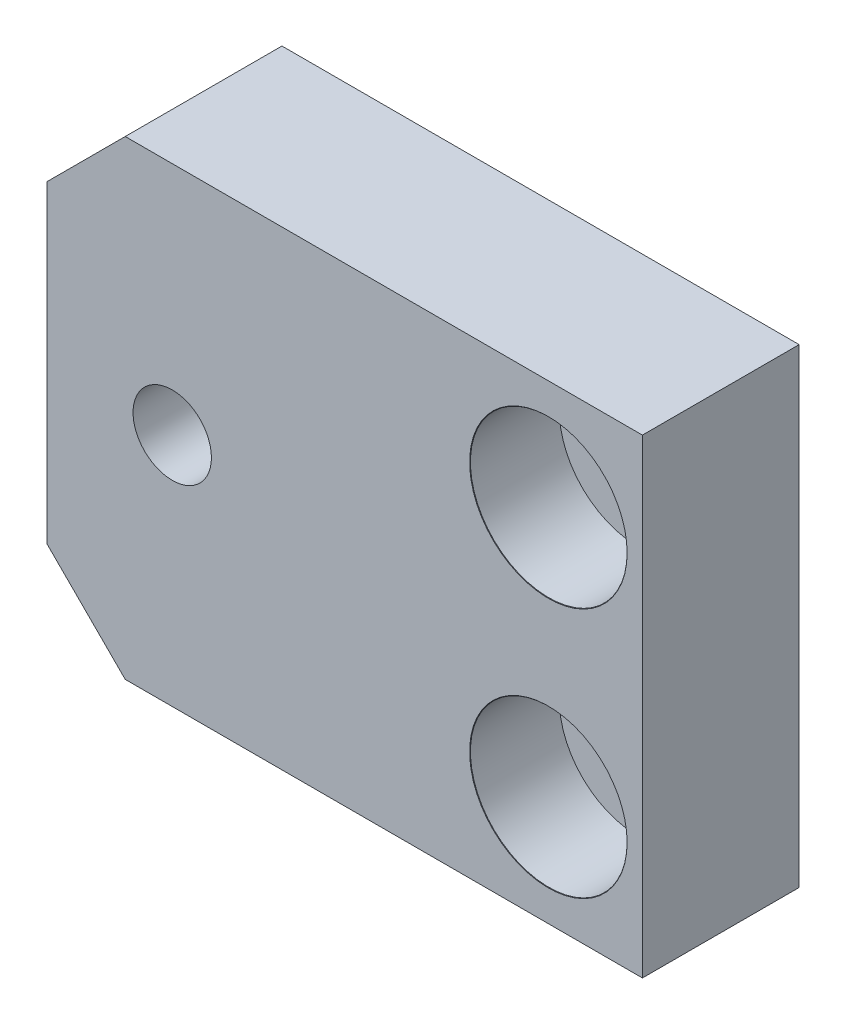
ISO-10303-21;
HEADER;
FILE_DESCRIPTION(('STEP AP214'),'2;1');
FILE_NAME('part.step','',(''),(''),'','','');
FILE_SCHEMA(('AUTOMOTIVE_DESIGN { 1 0 10303 214 1 1 1 1 }'));
ENDSEC;
DATA;
#1=APPLICATION_CONTEXT('core data for automotive mechanical design processes');
#2=APPLICATION_PROTOCOL_DEFINITION('international standard','automotive_design',2000,#1);
#3=PRODUCT_CONTEXT('',#1,'mechanical');
#4=PRODUCT('Part','Part','',(#3));
#5=PRODUCT_RELATED_PRODUCT_CATEGORY('part','',(#4));
#6=PRODUCT_DEFINITION_FORMATION('','',#4);
#7=PRODUCT_DEFINITION_CONTEXT('part definition',#1,'design');
#8=PRODUCT_DEFINITION('design','',#6,#7);
#9=PRODUCT_DEFINITION_SHAPE('','',#8);
#10=(LENGTH_UNIT() NAMED_UNIT(*) SI_UNIT(.MILLI.,.METRE.));
#11=(NAMED_UNIT(*) PLANE_ANGLE_UNIT() SI_UNIT($,.RADIAN.));
#12=(NAMED_UNIT(*) SI_UNIT($,.STERADIAN.) SOLID_ANGLE_UNIT());
#13=UNCERTAINTY_MEASURE_WITH_UNIT(LENGTH_MEASURE(1.E-05),#10,'distance_accuracy_value','');
#14=(GEOMETRIC_REPRESENTATION_CONTEXT(3) GLOBAL_UNCERTAINTY_ASSIGNED_CONTEXT((#13)) GLOBAL_UNIT_ASSIGNED_CONTEXT((#10,
#11,#12)) REPRESENTATION_CONTEXT('',''));
#15=CARTESIAN_POINT('',(0.,0.,0.));
#16=DIRECTION('',(0.,0.,1.));
#17=DIRECTION('',(1.,0.,0.));
#18=AXIS2_PLACEMENT_3D('',#15,#16,#17);
#19=CARTESIAN_POINT('',(41.4927569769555,-2.53999999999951,10.));
#20=DIRECTION('',(-1.,0.,0.));
#21=DIRECTION('',(0.,0.,1.));
#22=AXIS2_PLACEMENT_3D('',#19,#20,#21);
#23=PLANE('',#22);
#24=DIRECTION('',(0.,1.,0.));
#25=VECTOR('',#24,1.);
#26=CARTESIAN_POINT('',(41.4927569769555,-2.53999999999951,0.));
#27=LINE('',#26,#25);
#28=CARTESIAN_POINT('',(41.4927569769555,-2.53999999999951,0.));
#29=VERTEX_POINT('',#28);
#30=CARTESIAN_POINT('',(41.4927569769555,27.4600000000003,0.));
#31=VERTEX_POINT('',#30);
#32=EDGE_CURVE('E89',#29,#31,#27,.T.);
#33=ORIENTED_EDGE('',*,*,#32,.T.);
#34=DIRECTION('',(0.,0.,-1.));
#35=VECTOR('',#34,1.);
#36=CARTESIAN_POINT('',(41.4927569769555,27.4600000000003,10.));
#37=LINE('',#36,#35);
#38=CARTESIAN_POINT('',(41.4927569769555,27.4600000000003,10.));
#39=VERTEX_POINT('',#38);
#40=EDGE_CURVE('E72',#39,#31,#37,.T.);
#41=ORIENTED_EDGE('',*,*,#40,.F.);
#42=DIRECTION('',(0.,1.,0.));
#43=VECTOR('',#42,1.);
#44=CARTESIAN_POINT('',(41.4927569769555,-2.53999999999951,10.));
#45=LINE('',#44,#43);
#46=CARTESIAN_POINT('',(41.4927569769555,-2.53999999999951,10.));
#47=VERTEX_POINT('',#46);
#48=EDGE_CURVE('E77',#47,#39,#45,.T.);
#49=ORIENTED_EDGE('',*,*,#48,.F.);
#50=DIRECTION('',(0.,0.,-1.));
#51=VECTOR('',#50,1.);
#52=CARTESIAN_POINT('',(41.4927569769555,-2.53999999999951,10.));
#53=LINE('',#52,#51);
#54=EDGE_CURVE('E91',#47,#29,#53,.T.);
#55=ORIENTED_EDGE('',*,*,#54,.T.);
#56=EDGE_LOOP('',(#33,#41,#49,#55));
#57=FACE_BOUND('',#56,.T.);
#58=ADVANCED_FACE('F16',(#57),#23,.F.);
#59=CARTESIAN_POINT('',(41.4927569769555,27.4600000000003,10.));
#60=DIRECTION('',(0.,-1.,0.));
#61=DIRECTION('',(1.,0.,0.));
#62=AXIS2_PLACEMENT_3D('',#59,#60,#61);
#63=PLANE('',#62);
#64=DIRECTION('',(-1.,0.,0.));
#65=VECTOR('',#64,1.);
#66=CARTESIAN_POINT('',(41.4927569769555,27.4600000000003,0.));
#67=LINE('',#66,#65);
#68=CARTESIAN_POINT('',(8.49275697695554,27.4600000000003,0.));
#69=VERTEX_POINT('',#68);
#70=EDGE_CURVE('E121',#31,#69,#67,.T.);
#71=ORIENTED_EDGE('',*,*,#70,.T.);
#72=DIRECTION('',(0.,0.,1.));
#73=VECTOR('',#72,1.);
#74=CARTESIAN_POINT('',(8.49275697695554,27.4600000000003,10.));
#75=LINE('',#74,#73);
#76=CARTESIAN_POINT('',(8.49275697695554,27.4600000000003,10.));
#77=VERTEX_POINT('',#76);
#78=EDGE_CURVE('E11',#69,#77,#75,.T.);
#79=ORIENTED_EDGE('',*,*,#78,.T.);
#80=DIRECTION('',(-1.,0.,0.));
#81=VECTOR('',#80,1.);
#82=CARTESIAN_POINT('',(41.4927569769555,27.4600000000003,10.));
#83=LINE('',#82,#81);
#84=EDGE_CURVE('E68',#39,#77,#83,.T.);
#85=ORIENTED_EDGE('',*,*,#84,.F.);
#86=ORIENTED_EDGE('',*,*,#40,.T.);
#87=EDGE_LOOP('',(#71,#79,#85,#86));
#88=FACE_BOUND('',#87,.T.);
#89=ADVANCED_FACE('F70',(#88),#63,.F.);
#90=CARTESIAN_POINT('',(3.49275697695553,-2.53999999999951,10.));
#91=DIRECTION('',(1.,0.,0.));
#92=DIRECTION('',(0.,0.,-1.));
#93=AXIS2_PLACEMENT_3D('',#90,#91,#92);
#94=PLANE('',#93);
#95=DIRECTION('',(0.,-1.,0.));
#96=VECTOR('',#95,1.);
#97=CARTESIAN_POINT('',(3.49275697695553,-2.53999999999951,0.));
#98=LINE('',#97,#96);
#99=CARTESIAN_POINT('',(3.49275697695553,22.4600000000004,0.));
#100=VERTEX_POINT('',#99);
#101=CARTESIAN_POINT('',(3.49275697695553,2.46000000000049,0.));
#102=VERTEX_POINT('',#101);
#103=EDGE_CURVE('E118',#100,#102,#98,.T.);
#104=ORIENTED_EDGE('',*,*,#103,.T.);
#105=DIRECTION('',(0.,0.,1.));
#106=VECTOR('',#105,1.);
#107=CARTESIAN_POINT('',(3.49275697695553,2.46000000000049,10.));
#108=LINE('',#107,#106);
#109=CARTESIAN_POINT('',(3.49275697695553,2.4600000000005,10.));
#110=VERTEX_POINT('',#109);
#111=EDGE_CURVE('E37',#102,#110,#108,.T.);
#112=ORIENTED_EDGE('',*,*,#111,.T.);
#113=DIRECTION('',(0.,-1.,0.));
#114=VECTOR('',#113,1.);
#115=CARTESIAN_POINT('',(3.49275697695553,-2.53999999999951,10.));
#116=LINE('',#115,#114);
#117=CARTESIAN_POINT('',(3.49275697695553,22.4600000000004,10.));
#118=VERTEX_POINT('',#117);
#119=EDGE_CURVE('E76',#118,#110,#116,.T.);
#120=ORIENTED_EDGE('',*,*,#119,.F.);
#121=DIRECTION('',(0.,0.,-1.));
#122=VECTOR('',#121,1.);
#123=CARTESIAN_POINT('',(3.49275697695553,22.4600000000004,10.));
#124=LINE('',#123,#122);
#125=EDGE_CURVE('E102',#118,#100,#124,.T.);
#126=ORIENTED_EDGE('',*,*,#125,.T.);
#127=EDGE_LOOP('',(#104,#112,#120,#126));
#128=FACE_BOUND('',#127,.T.);
#129=ADVANCED_FACE('F119',(#128),#94,.F.);
#130=CARTESIAN_POINT('',(41.4927569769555,-2.53999999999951,10.));
#131=DIRECTION('',(0.,1.,0.));
#132=DIRECTION('',(-1.,0.,0.));
#133=AXIS2_PLACEMENT_3D('',#130,#131,#132);
#134=PLANE('',#133);
#135=DIRECTION('',(1.,0.,0.));
#136=VECTOR('',#135,1.);
#137=CARTESIAN_POINT('',(41.4927569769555,-2.53999999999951,10.));
#138=LINE('',#137,#136);
#139=CARTESIAN_POINT('',(8.49275697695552,-2.53999999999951,10.));
#140=VERTEX_POINT('',#139);
#141=EDGE_CURVE('E82',#140,#47,#138,.T.);
#142=ORIENTED_EDGE('',*,*,#141,.F.);
#143=DIRECTION('',(0.,0.,-1.));
#144=VECTOR('',#143,1.);
#145=CARTESIAN_POINT('',(8.49275697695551,-2.53999999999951,10.));
#146=LINE('',#145,#144);
#147=CARTESIAN_POINT('',(8.49275697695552,-2.53999999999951,0.));
#148=VERTEX_POINT('',#147);
#149=EDGE_CURVE('E90',#140,#148,#146,.T.);
#150=ORIENTED_EDGE('',*,*,#149,.T.);
#151=DIRECTION('',(1.,0.,0.));
#152=VECTOR('',#151,1.);
#153=CARTESIAN_POINT('',(41.4927569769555,-2.53999999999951,0.));
#154=LINE('',#153,#152);
#155=EDGE_CURVE('E86',#148,#29,#154,.T.);
#156=ORIENTED_EDGE('',*,*,#155,.T.);
#157=ORIENTED_EDGE('',*,*,#54,.F.);
#158=EDGE_LOOP('',(#142,#150,#156,#157));
#159=FACE_BOUND('',#158,.T.);
#160=ADVANCED_FACE('F111',(#159),#134,.F.);
#161=CARTESIAN_POINT('',(0.,0.,10.));
#162=DIRECTION('',(0.,0.,1.));
#163=DIRECTION('',(1.,0.,0.));
#164=AXIS2_PLACEMENT_3D('',#161,#162,#163);
#165=PLANE('',#164);
#166=CARTESIAN_POINT('',(11.4927569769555,12.4600000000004,10.));
#167=DIRECTION('',(0.,0.,1.));
#168=DIRECTION('',(1.,0.,0.));
#169=AXIS2_PLACEMENT_3D('',#166,#167,#168);
#170=CIRCLE('',#169,2.5);
#171=CARTESIAN_POINT('',(13.9927569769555,12.4600000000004,10.));
#172=VERTEX_POINT('',#171);
#173=EDGE_CURVE('E172',#172,#172,#170,.T.);
#174=ORIENTED_EDGE('',*,*,#173,.F.);
#175=EDGE_LOOP('',(#174));
#176=FACE_BOUND('',#175,.T.);
#177=CARTESIAN_POINT('',(35.4927569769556,20.4600000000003,10.));
#178=DIRECTION('',(0.,0.,1.));
#179=DIRECTION('',(1.,0.,0.));
#180=AXIS2_PLACEMENT_3D('',#177,#178,#179);
#181=CIRCLE('',#180,5.025);
#182=CARTESIAN_POINT('',(40.5177569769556,20.4600000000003,10.));
#183=VERTEX_POINT('',#182);
#184=EDGE_CURVE('E163',#183,#183,#181,.T.);
#185=ORIENTED_EDGE('',*,*,#184,.F.);
#186=EDGE_LOOP('',(#185));
#187=FACE_BOUND('',#186,.T.);
#188=CARTESIAN_POINT('',(35.4927569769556,4.46000000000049,10.));
#189=DIRECTION('',(0.,0.,1.));
#190=DIRECTION('',(1.,0.,0.));
#191=AXIS2_PLACEMENT_3D('',#188,#189,#190);
#192=CIRCLE('',#191,5.025);
#193=CARTESIAN_POINT('',(40.5177569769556,4.46000000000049,10.));
#194=VERTEX_POINT('',#193);
#195=EDGE_CURVE('E142',#194,#194,#192,.T.);
#196=ORIENTED_EDGE('',*,*,#195,.F.);
#197=EDGE_LOOP('',(#196));
#198=FACE_BOUND('',#197,.T.);
#199=ORIENTED_EDGE('',*,*,#119,.T.);
#200=DIRECTION('',(-0.707106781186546,0.707106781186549,0.));
#201=VECTOR('',#200,1.);
#202=CARTESIAN_POINT('',(2.97637848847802,2.97637848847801,10.));
#203=LINE('',#202,#201);
#204=EDGE_CURVE('E24',#110,#140,#203,.F.);
#205=ORIENTED_EDGE('',*,*,#204,.T.);
#206=ORIENTED_EDGE('',*,*,#141,.T.);
#207=ORIENTED_EDGE('',*,*,#48,.T.);
#208=ORIENTED_EDGE('',*,*,#84,.T.);
#209=DIRECTION('',(0.707106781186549,0.707106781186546,0.));
#210=VECTOR('',#209,1.);
#211=CARTESIAN_POINT('',(-9.48362151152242,9.48362151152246,10.));
#212=LINE('',#211,#210);
#213=EDGE_CURVE('E106',#77,#118,#212,.F.);
#214=ORIENTED_EDGE('',*,*,#213,.T.);
#215=EDGE_LOOP('',(#199,#205,#206,#207,#208,#214));
#216=FACE_BOUND('',#215,.T.);
#217=ADVANCED_FACE('F80',(#176,#187,#198,#216),#165,.T.);
#218=CARTESIAN_POINT('',(0.,0.,0.));
#219=DIRECTION('',(0.,0.,1.));
#220=DIRECTION('',(1.,0.,0.));
#221=AXIS2_PLACEMENT_3D('',#218,#219,#220);
#222=PLANE('',#221);
#223=CARTESIAN_POINT('',(11.4927569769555,12.4600000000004,0.));
#224=DIRECTION('',(0.,0.,1.));
#225=DIRECTION('',(1.,0.,0.));
#226=AXIS2_PLACEMENT_3D('',#223,#224,#225);
#227=CIRCLE('',#226,2.5);
#228=CARTESIAN_POINT('',(13.9927569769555,12.4600000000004,0.));
#229=VERTEX_POINT('',#228);
#230=EDGE_CURVE('E169',#229,#229,#227,.T.);
#231=ORIENTED_EDGE('',*,*,#230,.T.);
#232=EDGE_LOOP('',(#231));
#233=FACE_BOUND('',#232,.T.);
#234=CARTESIAN_POINT('',(35.4927569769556,20.4600000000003,0.));
#235=DIRECTION('',(0.,0.,1.));
#236=DIRECTION('',(1.,0.,0.));
#237=AXIS2_PLACEMENT_3D('',#234,#235,#236);
#238=CIRCLE('',#237,2.775);
#239=CARTESIAN_POINT('',(38.2677569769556,20.4600000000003,0.));
#240=VERTEX_POINT('',#239);
#241=EDGE_CURVE('E166',#240,#240,#238,.T.);
#242=ORIENTED_EDGE('',*,*,#241,.T.);
#243=EDGE_LOOP('',(#242));
#244=FACE_BOUND('',#243,.T.);
#245=CARTESIAN_POINT('',(35.4927569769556,4.46000000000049,0.));
#246=DIRECTION('',(0.,0.,1.));
#247=DIRECTION('',(1.,0.,0.));
#248=AXIS2_PLACEMENT_3D('',#245,#246,#247);
#249=CIRCLE('',#248,2.775);
#250=CARTESIAN_POINT('',(38.2677569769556,4.46000000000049,0.));
#251=VERTEX_POINT('',#250);
#252=EDGE_CURVE('E145',#251,#251,#249,.T.);
#253=ORIENTED_EDGE('',*,*,#252,.T.);
#254=EDGE_LOOP('',(#253));
#255=FACE_BOUND('',#254,.T.);
#256=ORIENTED_EDGE('',*,*,#155,.F.);
#257=DIRECTION('',(0.707106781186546,-0.707106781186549,0.));
#258=VECTOR('',#257,1.);
#259=CARTESIAN_POINT('',(8.49275697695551,-2.53999999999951,0.));
#260=LINE('',#259,#258);
#261=EDGE_CURVE('E100',#148,#102,#260,.F.);
#262=ORIENTED_EDGE('',*,*,#261,.T.);
#263=ORIENTED_EDGE('',*,*,#103,.F.);
#264=DIRECTION('',(-0.707106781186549,-0.707106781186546,0.));
#265=VECTOR('',#264,1.);
#266=CARTESIAN_POINT('',(3.49275697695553,22.4600000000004,0.));
#267=LINE('',#266,#265);
#268=EDGE_CURVE('E94',#100,#69,#267,.F.);
#269=ORIENTED_EDGE('',*,*,#268,.T.);
#270=ORIENTED_EDGE('',*,*,#70,.F.);
#271=ORIENTED_EDGE('',*,*,#32,.F.);
#272=EDGE_LOOP('',(#256,#262,#263,#269,#270,#271));
#273=FACE_BOUND('',#272,.T.);
#274=ADVANCED_FACE('F117',(#233,#244,#255,#273),#222,.F.);
#275=CARTESIAN_POINT('',(35.4927569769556,4.46000000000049,0.0250000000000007));
#276=DIRECTION('',(0.,0.,-1.));
#277=DIRECTION('',(-1.,0.,0.));
#278=AXIS2_PLACEMENT_3D('',#275,#276,#277);
#279=CONICAL_SURFACE('',#278,2.75,0.785398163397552);
#280=ORIENTED_EDGE('',*,*,#252,.F.);
#281=EDGE_LOOP('',(#280));
#282=FACE_BOUND('',#281,.T.);
#283=CARTESIAN_POINT('',(35.4927569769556,4.46000000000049,0.0250000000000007));
#284=DIRECTION('',(0.,0.,1.));
#285=DIRECTION('',(1.,0.,0.));
#286=AXIS2_PLACEMENT_3D('',#283,#284,#285);
#287=CIRCLE('',#286,2.75);
#288=CARTESIAN_POINT('',(38.2427569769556,4.46000000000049,0.0250000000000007));
#289=VERTEX_POINT('',#288);
#290=EDGE_CURVE('E125',#289,#289,#287,.T.);
#291=ORIENTED_EDGE('',*,*,#290,.T.);
#292=EDGE_LOOP('',(#291));
#293=FACE_BOUND('',#292,.T.);
#294=ADVANCED_FACE('F336',(#282,#293),#279,.F.);
#295=CARTESIAN_POINT('',(35.4927569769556,4.46000000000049,10.));
#296=DIRECTION('',(0.,0.,1.));
#297=DIRECTION('',(1.,0.,0.));
#298=AXIS2_PLACEMENT_3D('',#295,#296,#297);
#299=CYLINDRICAL_SURFACE('',#298,2.75);
#300=ORIENTED_EDGE('',*,*,#290,.F.);
#301=EDGE_LOOP('',(#300));
#302=FACE_BOUND('',#301,.T.);
#303=CARTESIAN_POINT('',(35.4927569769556,4.46000000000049,4.275));
#304=DIRECTION('',(0.,0.,1.));
#305=DIRECTION('',(1.,0.,0.));
#306=AXIS2_PLACEMENT_3D('',#303,#304,#305);
#307=CIRCLE('',#306,2.75);
#308=CARTESIAN_POINT('',(38.2427569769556,4.46000000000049,4.275));
#309=VERTEX_POINT('',#308);
#310=EDGE_CURVE('E130',#309,#309,#307,.T.);
#311=ORIENTED_EDGE('',*,*,#310,.T.);
#312=EDGE_LOOP('',(#311));
#313=FACE_BOUND('',#312,.T.);
#314=ADVANCED_FACE('F346',(#302,#313),#299,.F.);
#315=CARTESIAN_POINT('',(35.4927569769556,4.46000000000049,4.3));
#316=DIRECTION('',(0.,0.,1.));
#317=DIRECTION('',(1.,0.,0.));
#318=AXIS2_PLACEMENT_3D('',#315,#316,#317);
#319=CONICAL_SURFACE('',#318,2.775,0.785398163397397);
#320=ORIENTED_EDGE('',*,*,#310,.F.);
#321=EDGE_LOOP('',(#320));
#322=FACE_BOUND('',#321,.T.);
#323=CARTESIAN_POINT('',(35.4927569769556,4.46000000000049,4.3));
#324=DIRECTION('',(0.,0.,1.));
#325=DIRECTION('',(1.,0.,0.));
#326=AXIS2_PLACEMENT_3D('',#323,#324,#325);
#327=CIRCLE('',#326,2.775);
#328=CARTESIAN_POINT('',(38.2677569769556,4.46000000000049,4.3));
#329=VERTEX_POINT('',#328);
#330=EDGE_CURVE('E133',#329,#329,#327,.T.);
#331=ORIENTED_EDGE('',*,*,#330,.T.);
#332=EDGE_LOOP('',(#331));
#333=FACE_BOUND('',#332,.T.);
#334=ADVANCED_FACE('F356',(#322,#333),#319,.F.);
#335=CARTESIAN_POINT('',(38.2677569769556,4.46000000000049,4.3));
#336=DIRECTION('',(0.,0.,-1.));
#337=DIRECTION('',(-1.,0.,0.));
#338=AXIS2_PLACEMENT_3D('',#335,#336,#337);
#339=PLANE('',#338);
#340=ORIENTED_EDGE('',*,*,#330,.F.);
#341=EDGE_LOOP('',(#340));
#342=FACE_BOUND('',#341,.T.);
#343=CARTESIAN_POINT('',(35.4927569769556,4.46000000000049,4.3));
#344=DIRECTION('',(0.,0.,1.));
#345=DIRECTION('',(1.,0.,0.));
#346=AXIS2_PLACEMENT_3D('',#343,#344,#345);
#347=CIRCLE('',#346,5.);
#348=CARTESIAN_POINT('',(40.4927569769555,4.46000000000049,4.3));
#349=VERTEX_POINT('',#348);
#350=EDGE_CURVE('E136',#349,#349,#347,.T.);
#351=ORIENTED_EDGE('',*,*,#350,.T.);
#352=EDGE_LOOP('',(#351));
#353=FACE_BOUND('',#352,.T.);
#354=ADVANCED_FACE('F201',(#342,#353),#339,.F.);
#355=CARTESIAN_POINT('',(35.4927569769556,4.46000000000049,10.));
#356=DIRECTION('',(0.,0.,1.));
#357=DIRECTION('',(1.,0.,0.));
#358=AXIS2_PLACEMENT_3D('',#355,#356,#357);
#359=CYLINDRICAL_SURFACE('',#358,5.);
#360=ORIENTED_EDGE('',*,*,#350,.F.);
#361=EDGE_LOOP('',(#360));
#362=FACE_BOUND('',#361,.T.);
#363=CARTESIAN_POINT('',(35.4927569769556,4.46000000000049,9.975));
#364=DIRECTION('',(0.,0.,1.));
#365=DIRECTION('',(1.,0.,0.));
#366=AXIS2_PLACEMENT_3D('',#363,#364,#365);
#367=CIRCLE('',#366,5.);
#368=CARTESIAN_POINT('',(40.4927569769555,4.46000000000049,9.975));
#369=VERTEX_POINT('',#368);
#370=EDGE_CURVE('E139',#369,#369,#367,.T.);
#371=ORIENTED_EDGE('',*,*,#370,.T.);
#372=EDGE_LOOP('',(#371));
#373=FACE_BOUND('',#372,.T.);
#374=ADVANCED_FACE('F189',(#362,#373),#359,.F.);
#375=CARTESIAN_POINT('',(35.4927569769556,4.46000000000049,10.));
#376=DIRECTION('',(0.,0.,1.));
#377=DIRECTION('',(1.,0.,0.));
#378=AXIS2_PLACEMENT_3D('',#375,#376,#377);
#379=CONICAL_SURFACE('',#378,5.025,0.785398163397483);
#380=ORIENTED_EDGE('',*,*,#370,.F.);
#381=EDGE_LOOP('',(#380));
#382=FACE_BOUND('',#381,.T.);
#383=ORIENTED_EDGE('',*,*,#195,.T.);
#384=EDGE_LOOP('',(#383));
#385=FACE_BOUND('',#384,.T.);
#386=ADVANCED_FACE('F186',(#382,#385),#379,.F.);
#387=CARTESIAN_POINT('',(35.4927569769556,20.4600000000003,0.0250000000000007));
#388=DIRECTION('',(0.,0.,-1.));
#389=DIRECTION('',(-1.,0.,0.));
#390=AXIS2_PLACEMENT_3D('',#387,#388,#389);
#391=CONICAL_SURFACE('',#390,2.75,0.785398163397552);
#392=ORIENTED_EDGE('',*,*,#241,.F.);
#393=EDGE_LOOP('',(#392));
#394=FACE_BOUND('',#393,.T.);
#395=CARTESIAN_POINT('',(35.4927569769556,20.4600000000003,0.0250000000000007));
#396=DIRECTION('',(0.,0.,1.));
#397=DIRECTION('',(1.,0.,0.));
#398=AXIS2_PLACEMENT_3D('',#395,#396,#397);
#399=CIRCLE('',#398,2.75);
#400=CARTESIAN_POINT('',(38.2427569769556,20.4600000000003,0.0250000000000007));
#401=VERTEX_POINT('',#400);
#402=EDGE_CURVE('E148',#401,#401,#399,.T.);
#403=ORIENTED_EDGE('',*,*,#402,.T.);
#404=EDGE_LOOP('',(#403));
#405=FACE_BOUND('',#404,.T.);
#406=ADVANCED_FACE('F188',(#394,#405),#391,.F.);
#407=CARTESIAN_POINT('',(35.4927569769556,20.4600000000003,10.));
#408=DIRECTION('',(0.,0.,1.));
#409=DIRECTION('',(1.,0.,0.));
#410=AXIS2_PLACEMENT_3D('',#407,#408,#409);
#411=CYLINDRICAL_SURFACE('',#410,2.75);
#412=ORIENTED_EDGE('',*,*,#402,.F.);
#413=EDGE_LOOP('',(#412));
#414=FACE_BOUND('',#413,.T.);
#415=CARTESIAN_POINT('',(35.4927569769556,20.4600000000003,4.275));
#416=DIRECTION('',(0.,0.,1.));
#417=DIRECTION('',(1.,0.,0.));
#418=AXIS2_PLACEMENT_3D('',#415,#416,#417);
#419=CIRCLE('',#418,2.75);
#420=CARTESIAN_POINT('',(38.2427569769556,20.4600000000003,4.275));
#421=VERTEX_POINT('',#420);
#422=EDGE_CURVE('E151',#421,#421,#419,.T.);
#423=ORIENTED_EDGE('',*,*,#422,.T.);
#424=EDGE_LOOP('',(#423));
#425=FACE_BOUND('',#424,.T.);
#426=ADVANCED_FACE('F198',(#414,#425),#411,.F.);
#427=CARTESIAN_POINT('',(35.4927569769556,20.4600000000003,4.3));
#428=DIRECTION('',(0.,0.,1.));
#429=DIRECTION('',(1.,0.,0.));
#430=AXIS2_PLACEMENT_3D('',#427,#428,#429);
#431=CONICAL_SURFACE('',#430,2.775,0.785398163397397);
#432=ORIENTED_EDGE('',*,*,#422,.F.);
#433=EDGE_LOOP('',(#432));
#434=FACE_BOUND('',#433,.T.);
#435=CARTESIAN_POINT('',(35.4927569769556,20.4600000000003,4.3));
#436=DIRECTION('',(0.,0.,1.));
#437=DIRECTION('',(1.,0.,0.));
#438=AXIS2_PLACEMENT_3D('',#435,#436,#437);
#439=CIRCLE('',#438,2.775);
#440=CARTESIAN_POINT('',(38.2677569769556,20.4600000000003,4.3));
#441=VERTEX_POINT('',#440);
#442=EDGE_CURVE('E154',#441,#441,#439,.T.);
#443=ORIENTED_EDGE('',*,*,#442,.T.);
#444=EDGE_LOOP('',(#443));
#445=FACE_BOUND('',#444,.T.);
#446=ADVANCED_FACE('F236',(#434,#445),#431,.F.);
#447=CARTESIAN_POINT('',(38.2677569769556,20.4600000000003,4.3));
#448=DIRECTION('',(0.,0.,-1.));
#449=DIRECTION('',(-1.,0.,0.));
#450=AXIS2_PLACEMENT_3D('',#447,#448,#449);
#451=PLANE('',#450);
#452=ORIENTED_EDGE('',*,*,#442,.F.);
#453=EDGE_LOOP('',(#452));
#454=FACE_BOUND('',#453,.T.);
#455=CARTESIAN_POINT('',(35.4927569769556,20.4600000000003,4.3));
#456=DIRECTION('',(0.,0.,1.));
#457=DIRECTION('',(1.,0.,0.));
#458=AXIS2_PLACEMENT_3D('',#455,#456,#457);
#459=CIRCLE('',#458,5.);
#460=CARTESIAN_POINT('',(40.4927569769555,20.4600000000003,4.3));
#461=VERTEX_POINT('',#460);
#462=EDGE_CURVE('E157',#461,#461,#459,.T.);
#463=ORIENTED_EDGE('',*,*,#462,.T.);
#464=EDGE_LOOP('',(#463));
#465=FACE_BOUND('',#464,.T.);
#466=ADVANCED_FACE('F232',(#454,#465),#451,.F.);
#467=CARTESIAN_POINT('',(35.4927569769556,20.4600000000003,10.));
#468=DIRECTION('',(0.,0.,1.));
#469=DIRECTION('',(1.,0.,0.));
#470=AXIS2_PLACEMENT_3D('',#467,#468,#469);
#471=CYLINDRICAL_SURFACE('',#470,5.);
#472=ORIENTED_EDGE('',*,*,#462,.F.);
#473=EDGE_LOOP('',(#472));
#474=FACE_BOUND('',#473,.T.);
#475=CARTESIAN_POINT('',(35.4927569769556,20.4600000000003,9.975));
#476=DIRECTION('',(0.,0.,1.));
#477=DIRECTION('',(1.,0.,0.));
#478=AXIS2_PLACEMENT_3D('',#475,#476,#477);
#479=CIRCLE('',#478,5.);
#480=CARTESIAN_POINT('',(40.4927569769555,20.4600000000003,9.975));
#481=VERTEX_POINT('',#480);
#482=EDGE_CURVE('E160',#481,#481,#479,.T.);
#483=ORIENTED_EDGE('',*,*,#482,.T.);
#484=EDGE_LOOP('',(#483));
#485=FACE_BOUND('',#484,.T.);
#486=ADVANCED_FACE('F226',(#474,#485),#471,.F.);
#487=CARTESIAN_POINT('',(35.4927569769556,20.4600000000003,10.));
#488=DIRECTION('',(0.,0.,1.));
#489=DIRECTION('',(1.,0.,0.));
#490=AXIS2_PLACEMENT_3D('',#487,#488,#489);
#491=CONICAL_SURFACE('',#490,5.025,0.785398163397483);
#492=ORIENTED_EDGE('',*,*,#482,.F.);
#493=EDGE_LOOP('',(#492));
#494=FACE_BOUND('',#493,.T.);
#495=ORIENTED_EDGE('',*,*,#184,.T.);
#496=EDGE_LOOP('',(#495));
#497=FACE_BOUND('',#496,.T.);
#498=ADVANCED_FACE('F220',(#494,#497),#491,.F.);
#499=CARTESIAN_POINT('',(11.4927569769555,12.4600000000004,10.));
#500=DIRECTION('',(0.,0.,1.));
#501=DIRECTION('',(1.,0.,0.));
#502=AXIS2_PLACEMENT_3D('',#499,#500,#501);
#503=CYLINDRICAL_SURFACE('',#502,2.5);
#504=ORIENTED_EDGE('',*,*,#173,.T.);
#505=EDGE_LOOP('',(#504));
#506=FACE_BOUND('',#505,.T.);
#507=ORIENTED_EDGE('',*,*,#230,.F.);
#508=EDGE_LOOP('',(#507));
#509=FACE_BOUND('',#508,.T.);
#510=ADVANCED_FACE('F176',(#506,#509),#503,.F.);
#511=CARTESIAN_POINT('',(8.49275697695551,-2.53999999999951,10.));
#512=DIRECTION('',(0.707106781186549,0.707106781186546,0.));
#513=DIRECTION('',(0.,0.,-1.));
#514=AXIS2_PLACEMENT_3D('',#511,#512,#513);
#515=PLANE('',#514);
#516=ORIENTED_EDGE('',*,*,#204,.F.);
#517=ORIENTED_EDGE('',*,*,#111,.F.);
#518=ORIENTED_EDGE('',*,*,#261,.F.);
#519=ORIENTED_EDGE('',*,*,#149,.F.);
#520=EDGE_LOOP('',(#516,#517,#518,#519));
#521=FACE_BOUND('',#520,.T.);
#522=ADVANCED_FACE('F114',(#521),#515,.F.);
#523=CARTESIAN_POINT('',(3.49275697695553,22.4600000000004,10.));
#524=DIRECTION('',(0.707106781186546,-0.707106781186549,0.));
#525=DIRECTION('',(0.,0.,-1.));
#526=AXIS2_PLACEMENT_3D('',#523,#524,#525);
#527=PLANE('',#526);
#528=ORIENTED_EDGE('',*,*,#213,.F.);
#529=ORIENTED_EDGE('',*,*,#78,.F.);
#530=ORIENTED_EDGE('',*,*,#268,.F.);
#531=ORIENTED_EDGE('',*,*,#125,.F.);
#532=EDGE_LOOP('',(#528,#529,#530,#531));
#533=FACE_BOUND('',#532,.T.);
#534=ADVANCED_FACE('F18',(#533),#527,.F.);
#535=CLOSED_SHELL('',(#58,#89,#129,#160,#217,#274,#294,#314,#334,#354,#374,#386,#406,#426,#446,
#466,#486,#498,#510,#522,#534));
#536=MANIFOLD_SOLID_BREP('B1',#535);
#537=ADVANCED_BREP_SHAPE_REPRESENTATION('',(#18,#536),#14);
#538=SHAPE_DEFINITION_REPRESENTATION(#9,#537);
ENDSEC;
END-ISO-10303-21;
